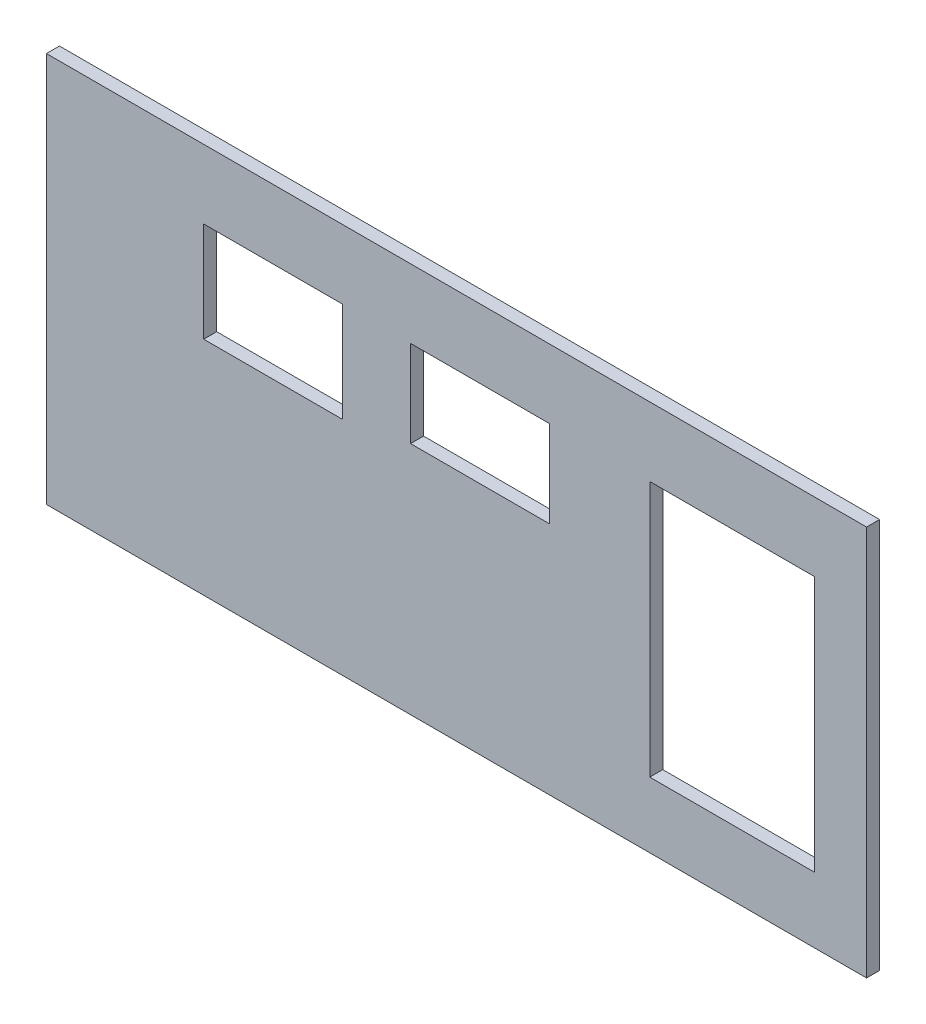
from build123d import *

# Parameters (mm, degrees)
ESBO_O2_W                = 189
ESBO_O2_H                = 90
ESBO_O2_W_2              = 38
ESBO_O2_H_2              = 59
ESBO_O2_W_3              = 32
ESBO_O2_H_3              = 20
ESBO_O2_H_4              = 23
RESSALTO_EXTRUS_O1_DEPTH = 3


with BuildPart() as part:
    # Esbo_o2 → Ressalto-extrus_o1 (new body)
    with BuildSketch(Plane.XY):
        with Locations((28.521490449, -7.796258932)):
            Rectangle(ESBO_O2_W, ESBO_O2_H)
        with Locations((92.058023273, -8.190492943)):
            Rectangle(ESBO_O2_W_2, ESBO_O2_H_2, mode=Mode.SUBTRACT)
        with Locations((33.934373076, 11.309507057)):
            Rectangle(ESBO_O2_W_3, ESBO_O2_H_3, mode=Mode.SUBTRACT)
        with Locations((-13.735276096, 9.809507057)):
            Rectangle(ESBO_O2_W_3, ESBO_O2_H_4, mode=Mode.SUBTRACT)
    extrude(amount=RESSALTO_EXTRUS_O1_DEPTH)


solid = part.part
